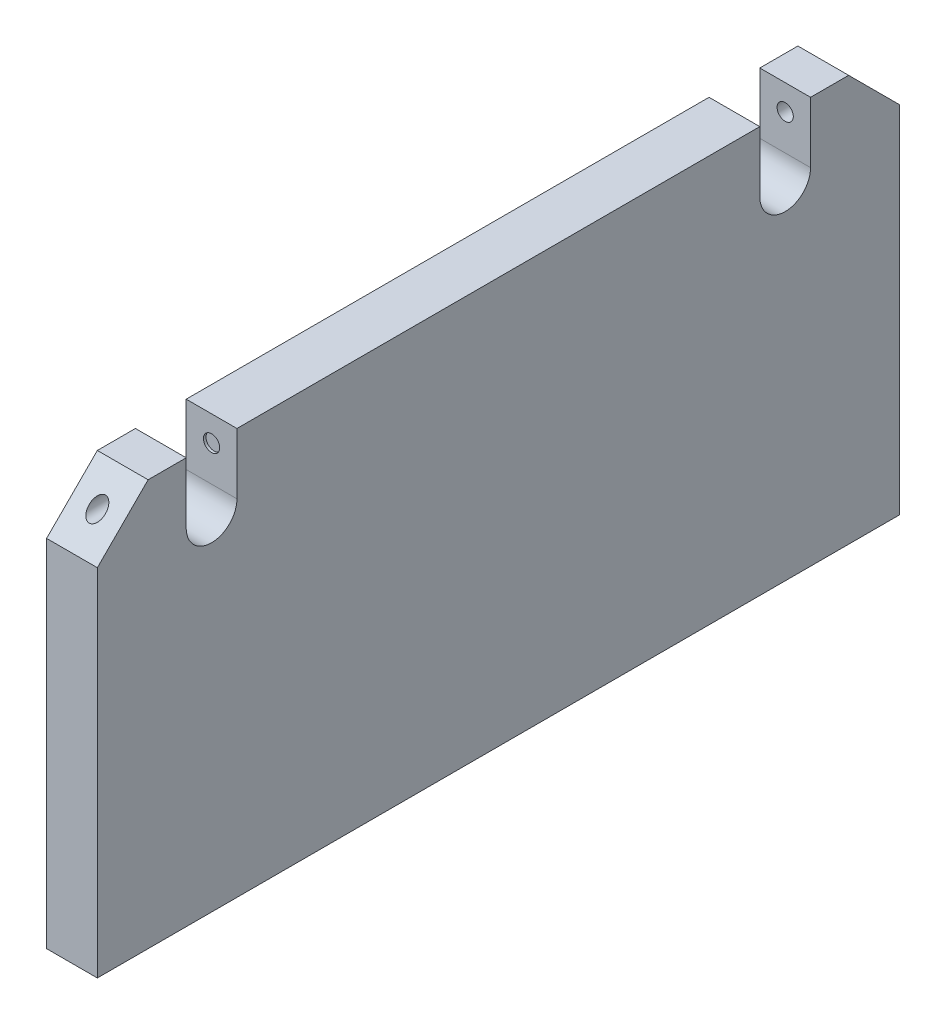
ISO-10303-21;
HEADER;
FILE_DESCRIPTION(('STEP AP214'),'2;1');
FILE_NAME('part.step','',(''),(''),'','','');
FILE_SCHEMA(('AUTOMOTIVE_DESIGN { 1 0 10303 214 1 1 1 1 }'));
ENDSEC;
DATA;
#1=APPLICATION_CONTEXT('core data for automotive mechanical design processes');
#2=APPLICATION_PROTOCOL_DEFINITION('international standard','automotive_design',2000,#1);
#3=PRODUCT_CONTEXT('',#1,'mechanical');
#4=PRODUCT('Part','Part','',(#3));
#5=PRODUCT_RELATED_PRODUCT_CATEGORY('part','',(#4));
#6=PRODUCT_DEFINITION_FORMATION('','',#4);
#7=PRODUCT_DEFINITION_CONTEXT('part definition',#1,'design');
#8=PRODUCT_DEFINITION('design','',#6,#7);
#9=PRODUCT_DEFINITION_SHAPE('','',#8);
#10=(LENGTH_UNIT() NAMED_UNIT(*) SI_UNIT(.MILLI.,.METRE.));
#11=(NAMED_UNIT(*) PLANE_ANGLE_UNIT() SI_UNIT($,.RADIAN.));
#12=(NAMED_UNIT(*) SI_UNIT($,.STERADIAN.) SOLID_ANGLE_UNIT());
#13=UNCERTAINTY_MEASURE_WITH_UNIT(LENGTH_MEASURE(1.E-05),#10,'distance_accuracy_value','');
#14=(GEOMETRIC_REPRESENTATION_CONTEXT(3) GLOBAL_UNCERTAINTY_ASSIGNED_CONTEXT((#13)) GLOBAL_UNIT_ASSIGNED_CONTEXT((#10,
#11,#12)) REPRESENTATION_CONTEXT('',''));
#15=CARTESIAN_POINT('',(0.,0.,0.));
#16=DIRECTION('',(0.,0.,1.));
#17=DIRECTION('',(1.,0.,0.));
#18=AXIS2_PLACEMENT_3D('',#15,#16,#17);
#19=CARTESIAN_POINT('',(10.,80.,-158.));
#20=DIRECTION('',(0.,-1.,0.));
#21=DIRECTION('',(0.,0.,-1.));
#22=AXIS2_PLACEMENT_3D('',#19,#20,#21);
#23=PLANE('',#22);
#24=DIRECTION('',(0.,0.,1.));
#25=VECTOR('',#24,1.);
#26=CARTESIAN_POINT('',(10.,80.,-158.));
#27=LINE('',#26,#25);
#28=CARTESIAN_POINT('',(10.,80.,-130.5));
#29=VERTEX_POINT('',#28);
#30=CARTESIAN_POINT('',(10.,80.,-27.5));
#31=VERTEX_POINT('',#30);
#32=EDGE_CURVE('E243',#29,#31,#27,.T.);
#33=ORIENTED_EDGE('',*,*,#32,.F.);
#34=DIRECTION('',(-1.,0.,0.));
#35=VECTOR('',#34,1.);
#36=CARTESIAN_POINT('',(10.,80.,-130.5));
#37=LINE('',#36,#35);
#38=CARTESIAN_POINT('',(0.,80.,-130.5));
#39=VERTEX_POINT('',#38);
#40=EDGE_CURVE('E174',#29,#39,#37,.T.);
#41=ORIENTED_EDGE('',*,*,#40,.T.);
#42=DIRECTION('',(0.,0.,1.));
#43=VECTOR('',#42,1.);
#44=CARTESIAN_POINT('',(0.,80.,-158.));
#45=LINE('',#44,#43);
#46=CARTESIAN_POINT('',(0.,80.,-27.5));
#47=VERTEX_POINT('',#46);
#48=EDGE_CURVE('E62',#39,#47,#45,.T.);
#49=ORIENTED_EDGE('',*,*,#48,.T.);
#50=DIRECTION('',(1.,0.,0.));
#51=VECTOR('',#50,1.);
#52=CARTESIAN_POINT('',(10.,80.,-27.5));
#53=LINE('',#52,#51);
#54=EDGE_CURVE('E199',#47,#31,#53,.T.);
#55=ORIENTED_EDGE('',*,*,#54,.T.);
#56=EDGE_LOOP('',(#33,#41,#49,#55));
#57=FACE_BOUND('',#56,.T.);
#58=ADVANCED_FACE('F37',(#57),#23,.F.);
#59=CARTESIAN_POINT('',(10.,80.,-17.5));
#60=VERTEX_POINT('',#59);
#61=CARTESIAN_POINT('',(10.,80.,-10.0000000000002));
#62=VERTEX_POINT('',#61);
#63=EDGE_CURVE('E240',#60,#62,#27,.T.);
#64=ORIENTED_EDGE('',*,*,#63,.F.);
#65=DIRECTION('',(-1.,0.,0.));
#66=VECTOR('',#65,1.);
#67=CARTESIAN_POINT('',(10.,80.,-17.5));
#68=LINE('',#67,#66);
#69=CARTESIAN_POINT('',(0.,80.,-17.5));
#70=VERTEX_POINT('',#69);
#71=EDGE_CURVE('E202',#60,#70,#68,.T.);
#72=ORIENTED_EDGE('',*,*,#71,.T.);
#73=CARTESIAN_POINT('',(0.,80.,-10.0000000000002));
#74=VERTEX_POINT('',#73);
#75=EDGE_CURVE('E228',#70,#74,#45,.T.);
#76=ORIENTED_EDGE('',*,*,#75,.T.);
#77=DIRECTION('',(1.,0.,0.));
#78=VECTOR('',#77,1.);
#79=CARTESIAN_POINT('',(10.,80.,-10.0000000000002));
#80=LINE('',#79,#78);
#81=EDGE_CURVE('E264',#74,#62,#80,.T.);
#82=ORIENTED_EDGE('',*,*,#81,.T.);
#83=EDGE_LOOP('',(#64,#72,#76,#82));
#84=FACE_BOUND('',#83,.T.);
#85=ADVANCED_FACE('F296',(#84),#23,.F.);
#86=CARTESIAN_POINT('',(5.,75.,-28.));
#87=DIRECTION('',(0.,0.,1.));
#88=DIRECTION('',(1.,0.,0.));
#89=AXIS2_PLACEMENT_3D('',#86,#87,#88);
#90=CYLINDRICAL_SURFACE('',#89,1.6);
#91=CARTESIAN_POINT('',(5.,75.,-17.5));
#92=DIRECTION('',(0.,0.,1.));
#93=DIRECTION('',(1.,0.,0.));
#94=AXIS2_PLACEMENT_3D('',#91,#92,#93);
#95=CIRCLE('',#94,1.6);
#96=CARTESIAN_POINT('',(6.6,75.,-17.5));
#97=VERTEX_POINT('',#96);
#98=EDGE_CURVE('E201',#97,#97,#95,.F.);
#99=ORIENTED_EDGE('',*,*,#98,.T.);
#100=EDGE_LOOP('',(#99));
#101=FACE_BOUND('',#100,.T.);
#102=CARTESIAN_POINT('',(5.,75.,-5.00000000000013));
#103=DIRECTION('',(0.,0.707106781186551,0.707106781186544));
#104=DIRECTION('',(0.,-0.707106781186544,0.707106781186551));
#105=AXIS2_PLACEMENT_3D('',#102,#103,#104);
#106=ELLIPSE('',#105,2.26274169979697,1.6);
#107=CARTESIAN_POINT('',(5.,73.4,-3.40000000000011));
#108=VERTEX_POINT('',#107);
#109=EDGE_CURVE('E212',#108,#108,#106,.T.);
#110=ORIENTED_EDGE('',*,*,#109,.T.);
#111=EDGE_LOOP('',(#110));
#112=FACE_BOUND('',#111,.T.);
#113=ADVANCED_FACE('F301',(#101,#112),#90,.F.);
#114=CARTESIAN_POINT('',(10.,0.,0.));
#115=DIRECTION('',(0.,0.,1.));
#116=DIRECTION('',(1.,0.,0.));
#117=AXIS2_PLACEMENT_3D('',#114,#115,#116);
#118=PLANE('',#117);
#119=DIRECTION('',(0.,1.,0.));
#120=VECTOR('',#119,1.);
#121=CARTESIAN_POINT('',(10.,0.,0.));
#122=LINE('',#121,#120);
#123=CARTESIAN_POINT('',(10.,0.,0.));
#124=VERTEX_POINT('',#123);
#125=CARTESIAN_POINT('',(10.,69.9999999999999,0.));
#126=VERTEX_POINT('',#125);
#127=EDGE_CURVE('E237',#124,#126,#122,.T.);
#128=ORIENTED_EDGE('',*,*,#127,.T.);
#129=DIRECTION('',(-1.,0.,0.));
#130=VECTOR('',#129,1.);
#131=CARTESIAN_POINT('',(0.,69.9999999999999,0.));
#132=LINE('',#131,#130);
#133=CARTESIAN_POINT('',(0.,69.9999999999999,0.));
#134=VERTEX_POINT('',#133);
#135=EDGE_CURVE('E251',#126,#134,#132,.T.);
#136=ORIENTED_EDGE('',*,*,#135,.T.);
#137=DIRECTION('',(0.,1.,0.));
#138=VECTOR('',#137,1.);
#139=CARTESIAN_POINT('',(0.,0.,0.));
#140=LINE('',#139,#138);
#141=CARTESIAN_POINT('',(0.,0.,0.));
#142=VERTEX_POINT('',#141);
#143=EDGE_CURVE('E225',#142,#134,#140,.T.);
#144=ORIENTED_EDGE('',*,*,#143,.F.);
#145=DIRECTION('',(-1.,0.,0.));
#146=VECTOR('',#145,1.);
#147=CARTESIAN_POINT('',(10.,0.,0.));
#148=LINE('',#147,#146);
#149=EDGE_CURVE('E249',#124,#142,#148,.T.);
#150=ORIENTED_EDGE('',*,*,#149,.F.);
#151=EDGE_LOOP('',(#128,#136,#144,#150));
#152=FACE_BOUND('',#151,.T.);
#153=ADVANCED_FACE('F39',(#152),#118,.T.);
#154=CARTESIAN_POINT('',(10.,0.,0.));
#155=DIRECTION('',(0.,1.,0.));
#156=DIRECTION('',(0.,0.,1.));
#157=AXIS2_PLACEMENT_3D('',#154,#155,#156);
#158=PLANE('',#157);
#159=CARTESIAN_POINT('',(4.99999999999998,0.,-134.));
#160=DIRECTION('',(0.,-1.,0.));
#161=DIRECTION('',(0.,0.,-1.));
#162=AXIS2_PLACEMENT_3D('',#159,#160,#161);
#163=CIRCLE('',#162,2.1);
#164=CARTESIAN_POINT('',(4.99999999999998,0.,-136.1));
#165=VERTEX_POINT('',#164);
#166=EDGE_CURVE('E213',#165,#165,#163,.T.);
#167=ORIENTED_EDGE('',*,*,#166,.F.);
#168=EDGE_LOOP('',(#167));
#169=FACE_BOUND('',#168,.T.);
#170=CARTESIAN_POINT('',(5.,0.,-24.));
#171=DIRECTION('',(0.,-1.,0.));
#172=DIRECTION('',(0.,0.,-1.));
#173=AXIS2_PLACEMENT_3D('',#170,#171,#172);
#174=CIRCLE('',#173,2.1);
#175=CARTESIAN_POINT('',(5.,0.,-26.1));
#176=VERTEX_POINT('',#175);
#177=EDGE_CURVE('E219',#176,#176,#174,.T.);
#178=ORIENTED_EDGE('',*,*,#177,.F.);
#179=EDGE_LOOP('',(#178));
#180=FACE_BOUND('',#179,.T.);
#181=DIRECTION('',(0.,0.,-1.));
#182=VECTOR('',#181,1.);
#183=CARTESIAN_POINT('',(0.,0.,0.));
#184=LINE('',#183,#182);
#185=CARTESIAN_POINT('',(0.,0.,-158.));
#186=VERTEX_POINT('',#185);
#187=EDGE_CURVE('E234',#142,#186,#184,.T.);
#188=ORIENTED_EDGE('',*,*,#187,.T.);
#189=DIRECTION('',(-1.,0.,0.));
#190=VECTOR('',#189,1.);
#191=CARTESIAN_POINT('',(10.,0.,-158.));
#192=LINE('',#191,#190);
#193=CARTESIAN_POINT('',(10.,0.,-158.));
#194=VERTEX_POINT('',#193);
#195=EDGE_CURVE('E248',#194,#186,#192,.T.);
#196=ORIENTED_EDGE('',*,*,#195,.F.);
#197=DIRECTION('',(0.,0.,-1.));
#198=VECTOR('',#197,1.);
#199=CARTESIAN_POINT('',(10.,0.,0.));
#200=LINE('',#199,#198);
#201=EDGE_CURVE('E245',#124,#194,#200,.T.);
#202=ORIENTED_EDGE('',*,*,#201,.F.);
#203=ORIENTED_EDGE('',*,*,#149,.T.);
#204=EDGE_LOOP('',(#188,#196,#202,#203));
#205=FACE_BOUND('',#204,.T.);
#206=ADVANCED_FACE('F314',(#169,#180,#205),#158,.F.);
#207=CARTESIAN_POINT('',(10.,80.,-158.));
#208=DIRECTION('',(0.,0.,-1.));
#209=DIRECTION('',(0.,1.,0.));
#210=AXIS2_PLACEMENT_3D('',#207,#208,#209);
#211=PLANE('',#210);
#212=DIRECTION('',(0.,-1.,0.));
#213=VECTOR('',#212,1.);
#214=CARTESIAN_POINT('',(0.,80.,-158.));
#215=LINE('',#214,#213);
#216=CARTESIAN_POINT('',(0.,69.9999999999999,-158.));
#217=VERTEX_POINT('',#216);
#218=EDGE_CURVE('E232',#217,#186,#215,.T.);
#219=ORIENTED_EDGE('',*,*,#218,.F.);
#220=DIRECTION('',(1.,0.,0.));
#221=VECTOR('',#220,1.);
#222=CARTESIAN_POINT('',(10.,69.9999999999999,-158.));
#223=LINE('',#222,#221);
#224=CARTESIAN_POINT('',(10.,69.9999999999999,-158.));
#225=VERTEX_POINT('',#224);
#226=EDGE_CURVE('E11',#217,#225,#223,.T.);
#227=ORIENTED_EDGE('',*,*,#226,.T.);
#228=DIRECTION('',(0.,-1.,0.));
#229=VECTOR('',#228,1.);
#230=CARTESIAN_POINT('',(10.,80.,-158.));
#231=LINE('',#230,#229);
#232=EDGE_CURVE('E242',#225,#194,#231,.T.);
#233=ORIENTED_EDGE('',*,*,#232,.T.);
#234=ORIENTED_EDGE('',*,*,#195,.T.);
#235=EDGE_LOOP('',(#219,#227,#233,#234));
#236=FACE_BOUND('',#235,.T.);
#237=ADVANCED_FACE('F306',(#236),#211,.T.);
#238=CARTESIAN_POINT('',(0.,80.,-148.));
#239=VERTEX_POINT('',#238);
#240=CARTESIAN_POINT('',(0.,80.,-140.5));
#241=VERTEX_POINT('',#240);
#242=EDGE_CURVE('E229',#239,#241,#45,.T.);
#243=ORIENTED_EDGE('',*,*,#242,.T.);
#244=DIRECTION('',(1.,0.,0.));
#245=VECTOR('',#244,1.);
#246=CARTESIAN_POINT('',(10.,80.,-140.5));
#247=LINE('',#246,#245);
#248=CARTESIAN_POINT('',(10.,80.,-140.5));
#249=VERTEX_POINT('',#248);
#250=EDGE_CURVE('E54',#241,#249,#247,.T.);
#251=ORIENTED_EDGE('',*,*,#250,.T.);
#252=CARTESIAN_POINT('',(10.,80.,-148.));
#253=VERTEX_POINT('',#252);
#254=EDGE_CURVE('E161',#253,#249,#27,.T.);
#255=ORIENTED_EDGE('',*,*,#254,.F.);
#256=DIRECTION('',(-1.,0.,0.));
#257=VECTOR('',#256,1.);
#258=CARTESIAN_POINT('',(0.,80.,-148.));
#259=LINE('',#258,#257);
#260=EDGE_CURVE('E261',#253,#239,#259,.T.);
#261=ORIENTED_EDGE('',*,*,#260,.T.);
#262=EDGE_LOOP('',(#243,#251,#255,#261));
#263=FACE_BOUND('',#262,.T.);
#264=ADVANCED_FACE('F297',(#263),#23,.F.);
#265=CARTESIAN_POINT('',(10.,0.,0.));
#266=DIRECTION('',(-1.,0.,0.));
#267=DIRECTION('',(0.,0.,1.));
#268=AXIS2_PLACEMENT_3D('',#265,#266,#267);
#269=PLANE('',#268);
#270=CARTESIAN_POINT('',(10.,68.,-135.5));
#271=DIRECTION('',(1.,0.,0.));
#272=DIRECTION('',(0.,0.,-1.));
#273=AXIS2_PLACEMENT_3D('',#270,#271,#272);
#274=CIRCLE('',#273,5.);
#275=CARTESIAN_POINT('',(10.,68.,-130.5));
#276=VERTEX_POINT('',#275);
#277=CARTESIAN_POINT('',(10.,68.,-140.5));
#278=VERTEX_POINT('',#277);
#279=EDGE_CURVE('E153',#276,#278,#274,.T.);
#280=ORIENTED_EDGE('',*,*,#279,.F.);
#281=DIRECTION('',(0.,-1.,0.));
#282=VECTOR('',#281,1.);
#283=CARTESIAN_POINT('',(10.,68.,-130.5));
#284=LINE('',#283,#282);
#285=EDGE_CURVE('E162',#29,#276,#284,.T.);
#286=ORIENTED_EDGE('',*,*,#285,.F.);
#287=ORIENTED_EDGE('',*,*,#32,.T.);
#288=DIRECTION('',(0.,1.,0.));
#289=VECTOR('',#288,1.);
#290=CARTESIAN_POINT('',(10.,68.,-27.5));
#291=LINE('',#290,#289);
#292=CARTESIAN_POINT('',(10.,68.,-27.5));
#293=VERTEX_POINT('',#292);
#294=EDGE_CURVE('E179',#293,#31,#291,.T.);
#295=ORIENTED_EDGE('',*,*,#294,.F.);
#296=CARTESIAN_POINT('',(10.,68.,-22.5));
#297=DIRECTION('',(1.,0.,0.));
#298=DIRECTION('',(0.,0.,-1.));
#299=AXIS2_PLACEMENT_3D('',#296,#297,#298);
#300=CIRCLE('',#299,5.);
#301=CARTESIAN_POINT('',(10.,68.,-17.5));
#302=VERTEX_POINT('',#301);
#303=EDGE_CURVE('E176',#302,#293,#300,.T.);
#304=ORIENTED_EDGE('',*,*,#303,.F.);
#305=DIRECTION('',(0.,-1.,0.));
#306=VECTOR('',#305,1.);
#307=CARTESIAN_POINT('',(10.,68.,-17.5));
#308=LINE('',#307,#306);
#309=EDGE_CURVE('E182',#60,#302,#308,.T.);
#310=ORIENTED_EDGE('',*,*,#309,.F.);
#311=ORIENTED_EDGE('',*,*,#63,.T.);
#312=DIRECTION('',(0.,-0.707106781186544,0.707106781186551));
#313=VECTOR('',#312,1.);
#314=CARTESIAN_POINT('',(10.,69.9999999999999,0.));
#315=LINE('',#314,#313);
#316=EDGE_CURVE('E46',#62,#126,#315,.T.);
#317=ORIENTED_EDGE('',*,*,#316,.T.);
#318=ORIENTED_EDGE('',*,*,#127,.F.);
#319=ORIENTED_EDGE('',*,*,#201,.T.);
#320=ORIENTED_EDGE('',*,*,#232,.F.);
#321=DIRECTION('',(0.,0.707106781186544,0.707106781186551));
#322=VECTOR('',#321,1.);
#323=CARTESIAN_POINT('',(10.,80.,-148.));
#324=LINE('',#323,#322);
#325=EDGE_CURVE('E267',#225,#253,#324,.T.);
#326=ORIENTED_EDGE('',*,*,#325,.T.);
#327=ORIENTED_EDGE('',*,*,#254,.T.);
#328=DIRECTION('',(0.,1.,0.));
#329=VECTOR('',#328,1.);
#330=CARTESIAN_POINT('',(10.,68.,-140.5));
#331=LINE('',#330,#329);
#332=EDGE_CURVE('E143',#278,#249,#331,.T.);
#333=ORIENTED_EDGE('',*,*,#332,.F.);
#334=EDGE_LOOP('',(#280,#286,#287,#295,#304,#310,#311,#317,#318,#319,#320,#326,#327,#333));
#335=FACE_BOUND('',#334,.T.);
#336=ADVANCED_FACE('F159',(#335),#269,.F.);
#337=CARTESIAN_POINT('',(0.,0.,0.));
#338=DIRECTION('',(-1.,0.,0.));
#339=DIRECTION('',(0.,0.,1.));
#340=AXIS2_PLACEMENT_3D('',#337,#338,#339);
#341=PLANE('',#340);
#342=DIRECTION('',(0.,-1.,0.));
#343=VECTOR('',#342,1.);
#344=CARTESIAN_POINT('',(0.,68.,-130.5));
#345=LINE('',#344,#343);
#346=CARTESIAN_POINT('',(0.,68.,-130.5));
#347=VERTEX_POINT('',#346);
#348=EDGE_CURVE('E149',#39,#347,#345,.T.);
#349=ORIENTED_EDGE('',*,*,#348,.T.);
#350=CARTESIAN_POINT('',(0.,68.,-135.5));
#351=DIRECTION('',(1.,0.,0.));
#352=DIRECTION('',(0.,0.,-1.));
#353=AXIS2_PLACEMENT_3D('',#350,#351,#352);
#354=CIRCLE('',#353,5.);
#355=CARTESIAN_POINT('',(0.,68.,-140.5));
#356=VERTEX_POINT('',#355);
#357=EDGE_CURVE('E164',#347,#356,#354,.T.);
#358=ORIENTED_EDGE('',*,*,#357,.T.);
#359=DIRECTION('',(0.,1.,0.));
#360=VECTOR('',#359,1.);
#361=CARTESIAN_POINT('',(0.,68.,-140.5));
#362=LINE('',#361,#360);
#363=EDGE_CURVE('E144',#356,#241,#362,.T.);
#364=ORIENTED_EDGE('',*,*,#363,.T.);
#365=ORIENTED_EDGE('',*,*,#242,.F.);
#366=DIRECTION('',(0.,-0.707106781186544,-0.707106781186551));
#367=VECTOR('',#366,1.);
#368=CARTESIAN_POINT('',(0.,114.,-113.999999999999));
#369=LINE('',#368,#367);
#370=EDGE_CURVE('E256',#239,#217,#369,.T.);
#371=ORIENTED_EDGE('',*,*,#370,.T.);
#372=ORIENTED_EDGE('',*,*,#218,.T.);
#373=ORIENTED_EDGE('',*,*,#187,.F.);
#374=ORIENTED_EDGE('',*,*,#143,.T.);
#375=DIRECTION('',(0.,0.707106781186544,-0.707106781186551));
#376=VECTOR('',#375,1.);
#377=CARTESIAN_POINT('',(0.,35.0000000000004,35.));
#378=LINE('',#377,#376);
#379=EDGE_CURVE('E258',#134,#74,#378,.T.);
#380=ORIENTED_EDGE('',*,*,#379,.T.);
#381=ORIENTED_EDGE('',*,*,#75,.F.);
#382=DIRECTION('',(0.,-1.,0.));
#383=VECTOR('',#382,1.);
#384=CARTESIAN_POINT('',(0.,68.,-17.5));
#385=LINE('',#384,#383);
#386=CARTESIAN_POINT('',(0.,68.,-17.5));
#387=VERTEX_POINT('',#386);
#388=EDGE_CURVE('E190',#70,#387,#385,.T.);
#389=ORIENTED_EDGE('',*,*,#388,.T.);
#390=CARTESIAN_POINT('',(0.,68.,-22.5));
#391=DIRECTION('',(1.,0.,0.));
#392=DIRECTION('',(0.,0.,-1.));
#393=AXIS2_PLACEMENT_3D('',#390,#391,#392);
#394=CIRCLE('',#393,5.);
#395=CARTESIAN_POINT('',(0.,68.,-27.5));
#396=VERTEX_POINT('',#395);
#397=EDGE_CURVE('E184',#387,#396,#394,.T.);
#398=ORIENTED_EDGE('',*,*,#397,.T.);
#399=DIRECTION('',(0.,1.,0.));
#400=VECTOR('',#399,1.);
#401=CARTESIAN_POINT('',(0.,68.,-27.5));
#402=LINE('',#401,#400);
#403=EDGE_CURVE('E187',#396,#47,#402,.T.);
#404=ORIENTED_EDGE('',*,*,#403,.T.);
#405=ORIENTED_EDGE('',*,*,#48,.F.);
#406=EDGE_LOOP('',(#349,#358,#364,#365,#371,#372,#373,#374,#380,#381,#389,#398,#404,#405));
#407=FACE_BOUND('',#406,.T.);
#408=ADVANCED_FACE('F312',(#407),#341,.T.);
#409=CARTESIAN_POINT('',(5.,15.,-24.));
#410=DIRECTION('',(0.,-1.,0.));
#411=DIRECTION('',(0.,0.,-1.));
#412=AXIS2_PLACEMENT_3D('',#409,#410,#411);
#413=CYLINDRICAL_SURFACE('',#412,2.1);
#414=CARTESIAN_POINT('',(5.,15.,-24.));
#415=DIRECTION('',(0.,-1.,0.));
#416=DIRECTION('',(0.,0.,-1.));
#417=AXIS2_PLACEMENT_3D('',#414,#415,#416);
#418=CIRCLE('',#417,2.1);
#419=CARTESIAN_POINT('',(5.,15.,-26.1));
#420=VERTEX_POINT('',#419);
#421=EDGE_CURVE('E222',#420,#420,#418,.T.);
#422=ORIENTED_EDGE('',*,*,#421,.F.);
#423=EDGE_LOOP('',(#422));
#424=FACE_BOUND('',#423,.T.);
#425=ORIENTED_EDGE('',*,*,#177,.T.);
#426=EDGE_LOOP('',(#425));
#427=FACE_BOUND('',#426,.T.);
#428=ADVANCED_FACE('F370',(#424,#427),#413,.F.);
#429=CARTESIAN_POINT('',(5.,15.,-24.));
#430=DIRECTION('',(0.,-1.,0.));
#431=DIRECTION('',(0.,0.,-1.));
#432=AXIS2_PLACEMENT_3D('',#429,#430,#431);
#433=PLANE('',#432);
#434=ORIENTED_EDGE('',*,*,#421,.T.);
#435=EDGE_LOOP('',(#434));
#436=FACE_BOUND('',#435,.T.);
#437=ADVANCED_FACE('F366',(#436),#433,.T.);
#438=CARTESIAN_POINT('',(4.99999999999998,15.,-134.));
#439=DIRECTION('',(0.,-1.,0.));
#440=DIRECTION('',(0.,0.,-1.));
#441=AXIS2_PLACEMENT_3D('',#438,#439,#440);
#442=CYLINDRICAL_SURFACE('',#441,2.1);
#443=CARTESIAN_POINT('',(4.99999999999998,15.,-134.));
#444=DIRECTION('',(0.,-1.,0.));
#445=DIRECTION('',(0.,0.,-1.));
#446=AXIS2_PLACEMENT_3D('',#443,#444,#445);
#447=CIRCLE('',#446,2.1);
#448=CARTESIAN_POINT('',(4.99999999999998,15.,-136.1));
#449=VERTEX_POINT('',#448);
#450=EDGE_CURVE('E216',#449,#449,#447,.T.);
#451=ORIENTED_EDGE('',*,*,#450,.F.);
#452=EDGE_LOOP('',(#451));
#453=FACE_BOUND('',#452,.T.);
#454=ORIENTED_EDGE('',*,*,#166,.T.);
#455=EDGE_LOOP('',(#454));
#456=FACE_BOUND('',#455,.T.);
#457=ADVANCED_FACE('F362',(#453,#456),#442,.F.);
#458=CARTESIAN_POINT('',(4.99999999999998,15.,-134.));
#459=DIRECTION('',(0.,-1.,0.));
#460=DIRECTION('',(0.,0.,-1.));
#461=AXIS2_PLACEMENT_3D('',#458,#459,#460);
#462=PLANE('',#461);
#463=ORIENTED_EDGE('',*,*,#450,.T.);
#464=EDGE_LOOP('',(#463));
#465=FACE_BOUND('',#464,.T.);
#466=ADVANCED_FACE('F353',(#465),#462,.T.);
#467=CARTESIAN_POINT('',(10.,69.9999999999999,0.));
#468=DIRECTION('',(0.,0.707106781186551,0.707106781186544));
#469=DIRECTION('',(0.,-0.707106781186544,0.707106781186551));
#470=AXIS2_PLACEMENT_3D('',#467,#468,#469);
#471=PLANE('',#470);
#472=ORIENTED_EDGE('',*,*,#109,.F.);
#473=EDGE_LOOP('',(#472));
#474=FACE_BOUND('',#473,.T.);
#475=ORIENTED_EDGE('',*,*,#316,.F.);
#476=ORIENTED_EDGE('',*,*,#81,.F.);
#477=ORIENTED_EDGE('',*,*,#379,.F.);
#478=ORIENTED_EDGE('',*,*,#135,.F.);
#479=EDGE_LOOP('',(#475,#476,#477,#478));
#480=FACE_BOUND('',#479,.T.);
#481=ADVANCED_FACE('F331',(#474,#480),#471,.T.);
#482=CARTESIAN_POINT('',(10.,80.,-148.));
#483=DIRECTION('',(0.,0.707106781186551,-0.707106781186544));
#484=DIRECTION('',(0.,0.707106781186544,0.707106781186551));
#485=AXIS2_PLACEMENT_3D('',#482,#483,#484);
#486=PLANE('',#485);
#487=CARTESIAN_POINT('',(5.,75.,-153.));
#488=DIRECTION('',(0.,0.707106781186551,-0.707106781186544));
#489=DIRECTION('',(0.,-0.707106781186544,-0.707106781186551));
#490=AXIS2_PLACEMENT_3D('',#487,#488,#489);
#491=ELLIPSE('',#490,2.26274169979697,1.6);
#492=CARTESIAN_POINT('',(5.,73.4,-154.6));
#493=VERTEX_POINT('',#492);
#494=EDGE_CURVE('E208',#493,#493,#491,.T.);
#495=ORIENTED_EDGE('',*,*,#494,.F.);
#496=EDGE_LOOP('',(#495));
#497=FACE_BOUND('',#496,.T.);
#498=ORIENTED_EDGE('',*,*,#325,.F.);
#499=ORIENTED_EDGE('',*,*,#226,.F.);
#500=ORIENTED_EDGE('',*,*,#370,.F.);
#501=ORIENTED_EDGE('',*,*,#260,.F.);
#502=EDGE_LOOP('',(#498,#499,#500,#501));
#503=FACE_BOUND('',#502,.T.);
#504=ADVANCED_FACE('F342',(#497,#503),#486,.T.);
#505=CARTESIAN_POINT('',(5.,75.,-130.));
#506=DIRECTION('',(0.,0.,-1.));
#507=DIRECTION('',(0.,1.,0.));
#508=AXIS2_PLACEMENT_3D('',#505,#506,#507);
#509=CYLINDRICAL_SURFACE('',#508,1.6);
#510=CARTESIAN_POINT('',(5.,75.,-140.5));
#511=DIRECTION('',(0.,0.,-1.));
#512=DIRECTION('',(-1.,0.,0.));
#513=AXIS2_PLACEMENT_3D('',#510,#511,#512);
#514=CIRCLE('',#513,1.6);
#515=CARTESIAN_POINT('',(3.39999999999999,75.,-140.5));
#516=VERTEX_POINT('',#515);
#517=EDGE_CURVE('E171',#516,#516,#514,.F.);
#518=ORIENTED_EDGE('',*,*,#517,.T.);
#519=EDGE_LOOP('',(#518));
#520=FACE_BOUND('',#519,.T.);
#521=ORIENTED_EDGE('',*,*,#494,.T.);
#522=EDGE_LOOP('',(#521));
#523=FACE_BOUND('',#522,.T.);
#524=ADVANCED_FACE('F280',(#520,#523),#509,.F.);
#525=CARTESIAN_POINT('',(0.,68.,-17.5));
#526=DIRECTION('',(0.,0.,1.));
#527=DIRECTION('',(1.,0.,0.));
#528=AXIS2_PLACEMENT_3D('',#525,#526,#527);
#529=PLANE('',#528);
#530=ORIENTED_EDGE('',*,*,#98,.F.);
#531=EDGE_LOOP('',(#530));
#532=FACE_BOUND('',#531,.T.);
#533=ORIENTED_EDGE('',*,*,#309,.T.);
#534=DIRECTION('',(1.,0.,0.));
#535=VECTOR('',#534,1.);
#536=CARTESIAN_POINT('',(0.,68.,-17.5));
#537=LINE('',#536,#535);
#538=EDGE_CURVE('E194',#387,#302,#537,.T.);
#539=ORIENTED_EDGE('',*,*,#538,.F.);
#540=ORIENTED_EDGE('',*,*,#388,.F.);
#541=ORIENTED_EDGE('',*,*,#71,.F.);
#542=EDGE_LOOP('',(#533,#539,#540,#541));
#543=FACE_BOUND('',#542,.T.);
#544=ADVANCED_FACE('F350',(#532,#543),#529,.F.);
#545=CARTESIAN_POINT('',(0.,68.,-27.5));
#546=DIRECTION('',(0.,0.,-1.));
#547=DIRECTION('',(0.,1.,0.));
#548=AXIS2_PLACEMENT_3D('',#545,#546,#547);
#549=PLANE('',#548);
#550=CARTESIAN_POINT('',(5.,75.,-27.5));
#551=DIRECTION('',(0.,0.,-1.));
#552=DIRECTION('',(0.,1.,0.));
#553=AXIS2_PLACEMENT_3D('',#550,#551,#552);
#554=CIRCLE('',#553,1.6);
#555=CARTESIAN_POINT('',(5.,76.6,-27.5));
#556=VERTEX_POINT('',#555);
#557=EDGE_CURVE('E197',#556,#556,#554,.F.);
#558=ORIENTED_EDGE('',*,*,#557,.F.);
#559=EDGE_LOOP('',(#558));
#560=FACE_BOUND('',#559,.T.);
#561=ORIENTED_EDGE('',*,*,#403,.F.);
#562=DIRECTION('',(1.,0.,0.));
#563=VECTOR('',#562,1.);
#564=CARTESIAN_POINT('',(0.,68.,-27.5));
#565=LINE('',#564,#563);
#566=EDGE_CURVE('E193',#396,#293,#565,.T.);
#567=ORIENTED_EDGE('',*,*,#566,.T.);
#568=ORIENTED_EDGE('',*,*,#294,.T.);
#569=ORIENTED_EDGE('',*,*,#54,.F.);
#570=EDGE_LOOP('',(#561,#567,#568,#569));
#571=FACE_BOUND('',#570,.T.);
#572=ADVANCED_FACE('F406',(#560,#571),#549,.F.);
#573=CARTESIAN_POINT('',(0.,68.,-22.5));
#574=DIRECTION('',(1.,0.,0.));
#575=DIRECTION('',(0.,0.,-1.));
#576=AXIS2_PLACEMENT_3D('',#573,#574,#575);
#577=CYLINDRICAL_SURFACE('',#576,5.);
#578=ORIENTED_EDGE('',*,*,#303,.T.);
#579=ORIENTED_EDGE('',*,*,#566,.F.);
#580=ORIENTED_EDGE('',*,*,#397,.F.);
#581=ORIENTED_EDGE('',*,*,#538,.T.);
#582=EDGE_LOOP('',(#578,#579,#580,#581));
#583=FACE_BOUND('',#582,.T.);
#584=ADVANCED_FACE('F400',(#583),#577,.F.);
#585=CARTESIAN_POINT('',(5.,75.,-28.));
#586=DIRECTION('',(0.,0.,1.));
#587=DIRECTION('',(1.,0.,0.));
#588=AXIS2_PLACEMENT_3D('',#585,#586,#587);
#589=PLANE('',#588);
#590=CARTESIAN_POINT('',(5.,75.,-28.));
#591=DIRECTION('',(0.,0.,1.));
#592=DIRECTION('',(1.,0.,0.));
#593=AXIS2_PLACEMENT_3D('',#590,#591,#592);
#594=CIRCLE('',#593,1.6);
#595=CARTESIAN_POINT('',(6.6,75.,-28.));
#596=VERTEX_POINT('',#595);
#597=EDGE_CURVE('E209',#596,#596,#594,.T.);
#598=ORIENTED_EDGE('',*,*,#597,.T.);
#599=EDGE_LOOP('',(#598));
#600=FACE_BOUND('',#599,.T.);
#601=ADVANCED_FACE('F395',(#600),#589,.T.);
#602=ORIENTED_EDGE('',*,*,#557,.T.);
#603=EDGE_LOOP('',(#602));
#604=FACE_BOUND('',#603,.T.);
#605=ORIENTED_EDGE('',*,*,#597,.F.);
#606=EDGE_LOOP('',(#605));
#607=FACE_BOUND('',#606,.T.);
#608=ADVANCED_FACE('F292',(#604,#607),#90,.F.);
#609=CARTESIAN_POINT('',(0.,68.,-130.5));
#610=DIRECTION('',(0.,0.,1.));
#611=DIRECTION('',(1.,0.,0.));
#612=AXIS2_PLACEMENT_3D('',#609,#610,#611);
#613=PLANE('',#612);
#614=CARTESIAN_POINT('',(5.,75.,-130.5));
#615=DIRECTION('',(0.,0.,1.));
#616=DIRECTION('',(1.,0.,0.));
#617=AXIS2_PLACEMENT_3D('',#614,#615,#616);
#618=CIRCLE('',#617,1.6);
#619=CARTESIAN_POINT('',(6.6,75.,-130.5));
#620=VERTEX_POINT('',#619);
#621=EDGE_CURVE('E41',#620,#620,#618,.F.);
#622=ORIENTED_EDGE('',*,*,#621,.F.);
#623=EDGE_LOOP('',(#622));
#624=FACE_BOUND('',#623,.T.);
#625=ORIENTED_EDGE('',*,*,#285,.T.);
#626=DIRECTION('',(1.,0.,0.));
#627=VECTOR('',#626,1.);
#628=CARTESIAN_POINT('',(0.,68.,-130.5));
#629=LINE('',#628,#627);
#630=EDGE_CURVE('E148',#347,#276,#629,.T.);
#631=ORIENTED_EDGE('',*,*,#630,.F.);
#632=ORIENTED_EDGE('',*,*,#348,.F.);
#633=ORIENTED_EDGE('',*,*,#40,.F.);
#634=EDGE_LOOP('',(#625,#631,#632,#633));
#635=FACE_BOUND('',#634,.T.);
#636=ADVANCED_FACE('F284',(#624,#635),#613,.F.);
#637=CARTESIAN_POINT('',(0.,68.,-140.5));
#638=DIRECTION('',(0.,0.,-1.));
#639=DIRECTION('',(-1.,0.,0.));
#640=AXIS2_PLACEMENT_3D('',#637,#638,#639);
#641=PLANE('',#640);
#642=ORIENTED_EDGE('',*,*,#517,.F.);
#643=EDGE_LOOP('',(#642));
#644=FACE_BOUND('',#643,.T.);
#645=ORIENTED_EDGE('',*,*,#363,.F.);
#646=DIRECTION('',(1.,0.,0.));
#647=VECTOR('',#646,1.);
#648=CARTESIAN_POINT('',(0.,68.,-140.5));
#649=LINE('',#648,#647);
#650=EDGE_CURVE('E139',#356,#278,#649,.T.);
#651=ORIENTED_EDGE('',*,*,#650,.T.);
#652=ORIENTED_EDGE('',*,*,#332,.T.);
#653=ORIENTED_EDGE('',*,*,#250,.F.);
#654=EDGE_LOOP('',(#645,#651,#652,#653));
#655=FACE_BOUND('',#654,.T.);
#656=ADVANCED_FACE('F141',(#644,#655),#641,.F.);
#657=CARTESIAN_POINT('',(0.,68.,-135.5));
#658=DIRECTION('',(1.,0.,0.));
#659=DIRECTION('',(0.,0.,-1.));
#660=AXIS2_PLACEMENT_3D('',#657,#658,#659);
#661=CYLINDRICAL_SURFACE('',#660,5.);
#662=ORIENTED_EDGE('',*,*,#279,.T.);
#663=ORIENTED_EDGE('',*,*,#650,.F.);
#664=ORIENTED_EDGE('',*,*,#357,.F.);
#665=ORIENTED_EDGE('',*,*,#630,.T.);
#666=EDGE_LOOP('',(#662,#663,#664,#665));
#667=FACE_BOUND('',#666,.T.);
#668=ADVANCED_FACE('F154',(#667),#661,.F.);
#669=CARTESIAN_POINT('',(5.,75.,-130.));
#670=DIRECTION('',(0.,0.,-1.));
#671=DIRECTION('',(0.,1.,0.));
#672=AXIS2_PLACEMENT_3D('',#669,#670,#671);
#673=PLANE('',#672);
#674=CARTESIAN_POINT('',(5.,75.,-130.));
#675=DIRECTION('',(0.,0.,-1.));
#676=DIRECTION('',(0.,1.,0.));
#677=AXIS2_PLACEMENT_3D('',#674,#675,#676);
#678=CIRCLE('',#677,1.6);
#679=CARTESIAN_POINT('',(5.,76.6,-130.));
#680=VERTEX_POINT('',#679);
#681=EDGE_CURVE('E205',#680,#680,#678,.T.);
#682=ORIENTED_EDGE('',*,*,#681,.T.);
#683=EDGE_LOOP('',(#682));
#684=FACE_BOUND('',#683,.T.);
#685=ADVANCED_FACE('F290',(#684),#673,.T.);
#686=ORIENTED_EDGE('',*,*,#621,.T.);
#687=EDGE_LOOP('',(#686));
#688=FACE_BOUND('',#687,.T.);
#689=ORIENTED_EDGE('',*,*,#681,.F.);
#690=EDGE_LOOP('',(#689));
#691=FACE_BOUND('',#690,.T.);
#692=ADVANCED_FACE('F352',(#688,#691),#509,.F.);
#693=CLOSED_SHELL('',(#58,#85,#113,#153,#206,#237,#264,#336,#408,#428,#437,#457,#466,#481,#504,
#524,#544,#572,#584,#601,#608,#636,#656,#668,#685,#692));
#694=MANIFOLD_SOLID_BREP('B2',#693);
#695=ADVANCED_BREP_SHAPE_REPRESENTATION('',(#18,#694),#14);
#696=SHAPE_DEFINITION_REPRESENTATION(#9,#695);
ENDSEC;
END-ISO-10303-21;
